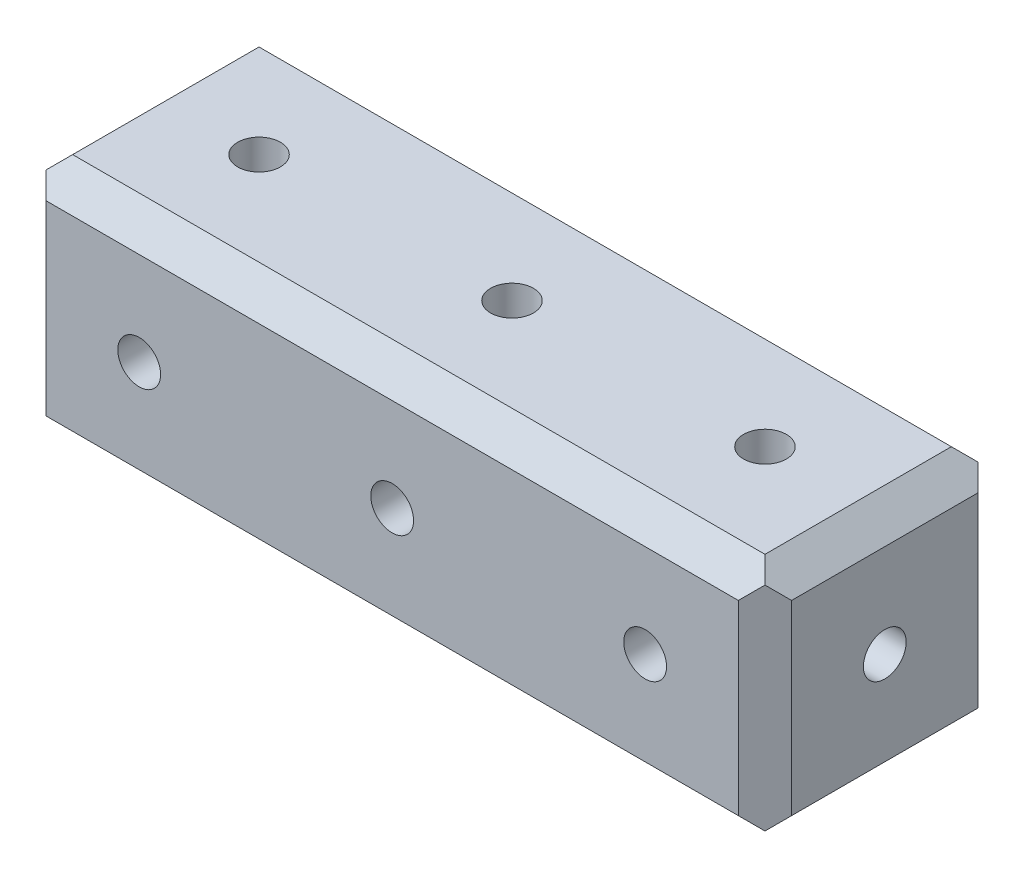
ISO-10303-21;
HEADER;
FILE_DESCRIPTION(('STEP AP214'),'2;1');
FILE_NAME('part.step','',(''),(''),'','','');
FILE_SCHEMA(('AUTOMOTIVE_DESIGN { 1 0 10303 214 1 1 1 1 }'));
ENDSEC;
DATA;
#1=APPLICATION_CONTEXT('core data for automotive mechanical design processes');
#2=APPLICATION_PROTOCOL_DEFINITION('international standard','automotive_design',2000,#1);
#3=PRODUCT_CONTEXT('',#1,'mechanical');
#4=PRODUCT('Part','Part','',(#3));
#5=PRODUCT_RELATED_PRODUCT_CATEGORY('part','',(#4));
#6=PRODUCT_DEFINITION_FORMATION('','',#4);
#7=PRODUCT_DEFINITION_CONTEXT('part definition',#1,'design');
#8=PRODUCT_DEFINITION('design','',#6,#7);
#9=PRODUCT_DEFINITION_SHAPE('','',#8);
#10=(LENGTH_UNIT() NAMED_UNIT(*) SI_UNIT(.MILLI.,.METRE.));
#11=(NAMED_UNIT(*) PLANE_ANGLE_UNIT() SI_UNIT($,.RADIAN.));
#12=(NAMED_UNIT(*) SI_UNIT($,.STERADIAN.) SOLID_ANGLE_UNIT());
#13=UNCERTAINTY_MEASURE_WITH_UNIT(LENGTH_MEASURE(1.E-05),#10,'distance_accuracy_value','');
#14=(GEOMETRIC_REPRESENTATION_CONTEXT(3) GLOBAL_UNCERTAINTY_ASSIGNED_CONTEXT((#13)) GLOBAL_UNIT_ASSIGNED_CONTEXT((#10,
#11,#12)) REPRESENTATION_CONTEXT('',''));
#15=CARTESIAN_POINT('',(0.,0.,0.));
#16=DIRECTION('',(0.,0.,1.));
#17=DIRECTION('',(1.,0.,0.));
#18=AXIS2_PLACEMENT_3D('',#15,#16,#17);
#19=CARTESIAN_POINT('',(0.,14.2875,0.));
#20=DIRECTION('',(0.,1.,0.));
#21=DIRECTION('',(0.,0.,1.));
#22=AXIS2_PLACEMENT_3D('',#19,#20,#21);
#23=CYLINDRICAL_SURFACE('',#22,2.5527);
#24=CARTESIAN_POINT('',(0.,14.2875,0.));
#25=DIRECTION('',(0.,1.,0.));
#26=DIRECTION('',(0.,0.,1.));
#27=AXIS2_PLACEMENT_3D('',#24,#25,#26);
#28=CIRCLE('',#27,2.5527);
#29=CARTESIAN_POINT('',(0.,14.2875,2.5527));
#30=VERTEX_POINT('',#29);
#31=EDGE_CURVE('E567',#30,#30,#28,.T.);
#32=ORIENTED_EDGE('',*,*,#31,.T.);
#33=EDGE_LOOP('',(#32));
#34=FACE_BOUND('',#33,.T.);
#35=CARTESIAN_POINT('',(0.,0.,0.));
#36=DIRECTION('',(0.,0.707106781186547,-0.707106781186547));
#37=DIRECTION('',(0.,0.707106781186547,0.707106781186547));
#38=AXIS2_PLACEMENT_3D('',#35,#36,#37);
#39=ELLIPSE('',#38,3.6100629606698,2.5527);
#40=CARTESIAN_POINT('',(1.8050314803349,1.8050314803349,1.8050314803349));
#41=VERTEX_POINT('',#40);
#42=CARTESIAN_POINT('',(-1.8050314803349,1.8050314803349,1.8050314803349));
#43=VERTEX_POINT('',#42);
#44=EDGE_CURVE('E572',#41,#43,#39,.F.);
#45=ORIENTED_EDGE('',*,*,#44,.T.);
#46=CARTESIAN_POINT('',(0.,0.,0.));
#47=DIRECTION('',(0.707106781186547,0.707106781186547,0.));
#48=DIRECTION('',(-0.707106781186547,0.707106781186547,0.));
#49=AXIS2_PLACEMENT_3D('',#46,#47,#48);
#50=ELLIPSE('',#49,3.6100629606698,2.5527);
#51=CARTESIAN_POINT('',(-1.8050314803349,1.8050314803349,-1.8050314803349));
#52=VERTEX_POINT('',#51);
#53=EDGE_CURVE('E555',#43,#52,#50,.F.);
#54=ORIENTED_EDGE('',*,*,#53,.T.);
#55=CARTESIAN_POINT('',(0.,0.,0.));
#56=DIRECTION('',(0.,0.707106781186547,0.707106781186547));
#57=DIRECTION('',(0.,0.707106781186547,-0.707106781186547));
#58=AXIS2_PLACEMENT_3D('',#55,#56,#57);
#59=ELLIPSE('',#58,3.6100629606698,2.5527);
#60=CARTESIAN_POINT('',(1.8050314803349,1.8050314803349,-1.8050314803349));
#61=VERTEX_POINT('',#60);
#62=EDGE_CURVE('E581',#52,#61,#59,.F.);
#63=ORIENTED_EDGE('',*,*,#62,.T.);
#64=CARTESIAN_POINT('',(0.,0.,0.));
#65=DIRECTION('',(-0.707106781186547,0.707106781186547,0.));
#66=DIRECTION('',(0.707106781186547,0.707106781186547,0.));
#67=AXIS2_PLACEMENT_3D('',#64,#65,#66);
#68=ELLIPSE('',#67,3.6100629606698,2.5527);
#69=EDGE_CURVE('E540',#61,#41,#68,.F.);
#70=ORIENTED_EDGE('',*,*,#69,.T.);
#71=EDGE_LOOP('',(#45,#54,#63,#70));
#72=FACE_BOUND('',#71,.T.);
#73=ADVANCED_FACE('F15',(#34,#72),#23,.F.);
#74=CARTESIAN_POINT('',(14.2875,-14.2875,14.2875));
#75=DIRECTION('',(0.,0.,1.));
#76=DIRECTION('',(1.,0.,0.));
#77=AXIS2_PLACEMENT_3D('',#74,#75,#76);
#78=PLANE('',#77);
#79=CARTESIAN_POINT('',(60.325,0.,14.2875));
#80=DIRECTION('',(0.,0.,1.));
#81=DIRECTION('',(1.,0.,0.));
#82=AXIS2_PLACEMENT_3D('',#79,#80,#81);
#83=CIRCLE('',#82,2.55269999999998);
#84=CARTESIAN_POINT('',(62.8777,0.,14.2875));
#85=VERTEX_POINT('',#84);
#86=EDGE_CURVE('E507',#85,#85,#83,.T.);
#87=ORIENTED_EDGE('',*,*,#86,.F.);
#88=EDGE_LOOP('',(#87));
#89=FACE_BOUND('',#88,.T.);
#90=CARTESIAN_POINT('',(30.1625,0.,14.2875));
#91=DIRECTION('',(0.,0.,1.));
#92=DIRECTION('',(1.,0.,0.));
#93=AXIS2_PLACEMENT_3D('',#90,#91,#92);
#94=CIRCLE('',#93,2.5527);
#95=CARTESIAN_POINT('',(32.7152,0.,14.2875));
#96=VERTEX_POINT('',#95);
#97=EDGE_CURVE('E537',#96,#96,#94,.T.);
#98=ORIENTED_EDGE('',*,*,#97,.F.);
#99=EDGE_LOOP('',(#98));
#100=FACE_BOUND('',#99,.T.);
#101=CARTESIAN_POINT('',(0.,0.,14.2875));
#102=DIRECTION('',(0.,0.,1.));
#103=DIRECTION('',(1.,0.,0.));
#104=AXIS2_PLACEMENT_3D('',#101,#102,#103);
#105=CIRCLE('',#104,2.5527);
#106=CARTESIAN_POINT('',(2.5527,0.,14.2875));
#107=VERTEX_POINT('',#106);
#108=EDGE_CURVE('E561',#107,#107,#105,.T.);
#109=ORIENTED_EDGE('',*,*,#108,.F.);
#110=EDGE_LOOP('',(#109));
#111=FACE_BOUND('',#110,.T.);
#112=DIRECTION('',(0.,-1.,0.));
#113=VECTOR('',#112,1.);
#114=CARTESIAN_POINT('',(-11.1125,-14.2875,14.2875));
#115=LINE('',#114,#113);
#116=CARTESIAN_POINT('',(-11.1125,11.1125,14.2875));
#117=VERTEX_POINT('',#116);
#118=CARTESIAN_POINT('',(-11.1125,-11.1125,14.2875));
#119=VERTEX_POINT('',#118);
#120=EDGE_CURVE('E285',#117,#119,#115,.T.);
#121=ORIENTED_EDGE('',*,*,#120,.T.);
#122=DIRECTION('',(1.,0.,0.));
#123=VECTOR('',#122,1.);
#124=CARTESIAN_POINT('',(14.2875,-11.1125,14.2875));
#125=LINE('',#124,#123);
#126=CARTESIAN_POINT('',(71.4375,-11.1125,14.2875));
#127=VERTEX_POINT('',#126);
#128=EDGE_CURVE('E339',#119,#127,#125,.T.);
#129=ORIENTED_EDGE('',*,*,#128,.T.);
#130=DIRECTION('',(0.,1.,0.));
#131=VECTOR('',#130,1.);
#132=CARTESIAN_POINT('',(71.4375,-14.2875,14.2875));
#133=LINE('',#132,#131);
#134=CARTESIAN_POINT('',(71.4375,11.1125,14.2875));
#135=VERTEX_POINT('',#134);
#136=EDGE_CURVE('E288',#127,#135,#133,.T.);
#137=ORIENTED_EDGE('',*,*,#136,.T.);
#138=DIRECTION('',(-1.,0.,0.));
#139=VECTOR('',#138,1.);
#140=CARTESIAN_POINT('',(14.2875,11.1125,14.2875));
#141=LINE('',#140,#139);
#142=EDGE_CURVE('E336',#135,#117,#141,.T.);
#143=ORIENTED_EDGE('',*,*,#142,.T.);
#144=EDGE_LOOP('',(#121,#129,#137,#143));
#145=FACE_BOUND('',#144,.T.);
#146=ADVANCED_FACE('F366',(#89,#100,#111,#145),#78,.T.);
#147=CARTESIAN_POINT('',(14.2875,-14.2875,-14.2875));
#148=DIRECTION('',(0.,-1.,0.));
#149=DIRECTION('',(1.,0.,0.));
#150=AXIS2_PLACEMENT_3D('',#147,#148,#149);
#151=PLANE('',#150);
#152=CARTESIAN_POINT('',(60.325,-14.2875,1.51002848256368E-13));
#153=DIRECTION('',(0.,-1.,0.));
#154=DIRECTION('',(1.,0.,0.));
#155=AXIS2_PLACEMENT_3D('',#152,#153,#154);
#156=CIRCLE('',#155,2.55269999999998);
#157=CARTESIAN_POINT('',(62.8777,-14.2875,1.50692910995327E-13));
#158=VERTEX_POINT('',#157);
#159=EDGE_CURVE('E498',#158,#158,#156,.T.);
#160=ORIENTED_EDGE('',*,*,#159,.F.);
#161=EDGE_LOOP('',(#160));
#162=FACE_BOUND('',#161,.T.);
#163=CARTESIAN_POINT('',(30.1625,-14.2875,1.49460871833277E-13));
#164=DIRECTION('',(0.,-1.,0.));
#165=DIRECTION('',(1.,0.,0.));
#166=AXIS2_PLACEMENT_3D('',#163,#164,#165);
#167=CIRCLE('',#166,2.5527);
#168=CARTESIAN_POINT('',(32.7152,-14.2875,1.49150934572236E-13));
#169=VERTEX_POINT('',#168);
#170=EDGE_CURVE('E528',#169,#169,#167,.T.);
#171=ORIENTED_EDGE('',*,*,#170,.F.);
#172=EDGE_LOOP('',(#171));
#173=FACE_BOUND('',#172,.T.);
#174=CARTESIAN_POINT('',(0.,-14.2875,0.));
#175=DIRECTION('',(0.,1.,0.));
#176=DIRECTION('',(0.,0.,1.));
#177=AXIS2_PLACEMENT_3D('',#174,#175,#176);
#178=CIRCLE('',#177,2.5527);
#179=CARTESIAN_POINT('',(0.,-14.2875,2.5527));
#180=VERTEX_POINT('',#179);
#181=EDGE_CURVE('E569',#180,#180,#178,.T.);
#182=ORIENTED_EDGE('',*,*,#181,.T.);
#183=EDGE_LOOP('',(#182));
#184=FACE_BOUND('',#183,.T.);
#185=DIRECTION('',(0.,0.,-1.));
#186=VECTOR('',#185,1.);
#187=CARTESIAN_POINT('',(-11.1125,-14.2875,-14.2875));
#188=LINE('',#187,#186);
#189=CARTESIAN_POINT('',(-11.1125,-14.2875,11.1125));
#190=VERTEX_POINT('',#189);
#191=CARTESIAN_POINT('',(-11.1125,-14.2875,-11.1125));
#192=VERTEX_POINT('',#191);
#193=EDGE_CURVE('E249',#190,#192,#188,.T.);
#194=ORIENTED_EDGE('',*,*,#193,.T.);
#195=DIRECTION('',(1.,0.,0.));
#196=VECTOR('',#195,1.);
#197=CARTESIAN_POINT('',(14.2875,-14.2875,-11.1125));
#198=LINE('',#197,#196);
#199=CARTESIAN_POINT('',(71.4375,-14.2875,-11.1125));
#200=VERTEX_POINT('',#199);
#201=EDGE_CURVE('E322',#192,#200,#198,.T.);
#202=ORIENTED_EDGE('',*,*,#201,.T.);
#203=DIRECTION('',(0.,0.,1.));
#204=VECTOR('',#203,1.);
#205=CARTESIAN_POINT('',(71.4375,-14.2875,-14.2875));
#206=LINE('',#205,#204);
#207=CARTESIAN_POINT('',(71.4375,-14.2875,11.1125));
#208=VERTEX_POINT('',#207);
#209=EDGE_CURVE('E246',#200,#208,#206,.T.);
#210=ORIENTED_EDGE('',*,*,#209,.T.);
#211=DIRECTION('',(-1.,0.,0.));
#212=VECTOR('',#211,1.);
#213=CARTESIAN_POINT('',(14.2875,-14.2875,11.1125));
#214=LINE('',#213,#212);
#215=EDGE_CURVE('E319',#208,#190,#214,.T.);
#216=ORIENTED_EDGE('',*,*,#215,.T.);
#217=EDGE_LOOP('',(#194,#202,#210,#216));
#218=FACE_BOUND('',#217,.T.);
#219=ADVANCED_FACE('F384',(#162,#173,#184,#218),#151,.T.);
#220=CARTESIAN_POINT('',(14.2875,14.2875,-14.2875));
#221=DIRECTION('',(0.,0.,-1.));
#222=DIRECTION('',(-1.,0.,0.));
#223=AXIS2_PLACEMENT_3D('',#220,#221,#222);
#224=PLANE('',#223);
#225=CARTESIAN_POINT('',(60.325,0.,-14.2875));
#226=DIRECTION('',(0.,0.,-1.));
#227=DIRECTION('',(1.,0.,0.));
#228=AXIS2_PLACEMENT_3D('',#225,#226,#227);
#229=CIRCLE('',#228,2.55269999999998);
#230=CARTESIAN_POINT('',(62.8777,0.,-14.2875));
#231=VERTEX_POINT('',#230);
#232=EDGE_CURVE('E501',#231,#231,#229,.T.);
#233=ORIENTED_EDGE('',*,*,#232,.F.);
#234=EDGE_LOOP('',(#233));
#235=FACE_BOUND('',#234,.T.);
#236=CARTESIAN_POINT('',(30.1625,0.,-14.2875));
#237=DIRECTION('',(0.,0.,-1.));
#238=DIRECTION('',(1.,0.,0.));
#239=AXIS2_PLACEMENT_3D('',#236,#237,#238);
#240=CIRCLE('',#239,2.5527);
#241=CARTESIAN_POINT('',(32.7152,0.,-14.2875));
#242=VERTEX_POINT('',#241);
#243=EDGE_CURVE('E531',#242,#242,#240,.T.);
#244=ORIENTED_EDGE('',*,*,#243,.F.);
#245=EDGE_LOOP('',(#244));
#246=FACE_BOUND('',#245,.T.);
#247=CARTESIAN_POINT('',(0.,0.,-14.2875));
#248=DIRECTION('',(0.,0.,-1.));
#249=DIRECTION('',(-1.,0.,0.));
#250=AXIS2_PLACEMENT_3D('',#247,#248,#249);
#251=CIRCLE('',#250,2.5527);
#252=CARTESIAN_POINT('',(-2.5527,0.,-14.2875));
#253=VERTEX_POINT('',#252);
#254=EDGE_CURVE('E564',#253,#253,#251,.T.);
#255=ORIENTED_EDGE('',*,*,#254,.F.);
#256=EDGE_LOOP('',(#255));
#257=FACE_BOUND('',#256,.T.);
#258=DIRECTION('',(0.,-1.,0.));
#259=VECTOR('',#258,1.);
#260=CARTESIAN_POINT('',(71.4375,14.2875,-14.2875));
#261=LINE('',#260,#259);
#262=CARTESIAN_POINT('',(71.4375,11.1125,-14.2875));
#263=VERTEX_POINT('',#262);
#264=CARTESIAN_POINT('',(71.4375,-11.1125,-14.2875));
#265=VERTEX_POINT('',#264);
#266=EDGE_CURVE('E277',#263,#265,#261,.T.);
#267=ORIENTED_EDGE('',*,*,#266,.T.);
#268=DIRECTION('',(-1.,0.,0.));
#269=VECTOR('',#268,1.);
#270=CARTESIAN_POINT('',(14.2875,-11.1125,-14.2875));
#271=LINE('',#270,#269);
#272=CARTESIAN_POINT('',(-11.1125,-11.1125,-14.2875));
#273=VERTEX_POINT('',#272);
#274=EDGE_CURVE('E308',#265,#273,#271,.T.);
#275=ORIENTED_EDGE('',*,*,#274,.T.);
#276=DIRECTION('',(0.,1.,0.));
#277=VECTOR('',#276,1.);
#278=CARTESIAN_POINT('',(-11.1125,14.2875,-14.2875));
#279=LINE('',#278,#277);
#280=CARTESIAN_POINT('',(-11.1125,11.1125,-14.2875));
#281=VERTEX_POINT('',#280);
#282=EDGE_CURVE('E274',#273,#281,#279,.T.);
#283=ORIENTED_EDGE('',*,*,#282,.T.);
#284=DIRECTION('',(1.,0.,0.));
#285=VECTOR('',#284,1.);
#286=CARTESIAN_POINT('',(14.2875,11.1125,-14.2875));
#287=LINE('',#286,#285);
#288=EDGE_CURVE('E306',#281,#263,#287,.T.);
#289=ORIENTED_EDGE('',*,*,#288,.T.);
#290=EDGE_LOOP('',(#267,#275,#283,#289));
#291=FACE_BOUND('',#290,.T.);
#292=ADVANCED_FACE('F402',(#235,#246,#257,#291),#224,.T.);
#293=CARTESIAN_POINT('',(14.2875,14.2875,14.2875));
#294=DIRECTION('',(0.,1.,0.));
#295=DIRECTION('',(-1.,0.,0.));
#296=AXIS2_PLACEMENT_3D('',#293,#294,#295);
#297=PLANE('',#296);
#298=CARTESIAN_POINT('',(60.325,14.2875,0.));
#299=DIRECTION('',(0.,1.,0.));
#300=DIRECTION('',(1.,0.,0.));
#301=AXIS2_PLACEMENT_3D('',#298,#299,#300);
#302=CIRCLE('',#301,2.55269999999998);
#303=CARTESIAN_POINT('',(62.8777,14.2875,0.));
#304=VERTEX_POINT('',#303);
#305=EDGE_CURVE('E504',#304,#304,#302,.T.);
#306=ORIENTED_EDGE('',*,*,#305,.F.);
#307=EDGE_LOOP('',(#306));
#308=FACE_BOUND('',#307,.T.);
#309=CARTESIAN_POINT('',(30.1625,14.2875,0.));
#310=DIRECTION('',(0.,1.,0.));
#311=DIRECTION('',(1.,0.,0.));
#312=AXIS2_PLACEMENT_3D('',#309,#310,#311);
#313=CIRCLE('',#312,2.5527);
#314=CARTESIAN_POINT('',(32.7152,14.2875,0.));
#315=VERTEX_POINT('',#314);
#316=EDGE_CURVE('E534',#315,#315,#313,.T.);
#317=ORIENTED_EDGE('',*,*,#316,.F.);
#318=EDGE_LOOP('',(#317));
#319=FACE_BOUND('',#318,.T.);
#320=ORIENTED_EDGE('',*,*,#31,.F.);
#321=EDGE_LOOP('',(#320));
#322=FACE_BOUND('',#321,.T.);
#323=DIRECTION('',(0.,0.,-1.));
#324=VECTOR('',#323,1.);
#325=CARTESIAN_POINT('',(71.4375,14.2875,14.2875));
#326=LINE('',#325,#324);
#327=CARTESIAN_POINT('',(71.4375,14.2875,11.1125));
#328=VERTEX_POINT('',#327);
#329=CARTESIAN_POINT('',(71.4375,14.2875,-11.1125));
#330=VERTEX_POINT('',#329);
#331=EDGE_CURVE('E260',#328,#330,#326,.T.);
#332=ORIENTED_EDGE('',*,*,#331,.T.);
#333=DIRECTION('',(-1.,0.,0.));
#334=VECTOR('',#333,1.);
#335=CARTESIAN_POINT('',(14.2875,14.2875,-11.1125));
#336=LINE('',#335,#334);
#337=CARTESIAN_POINT('',(-11.1125,14.2875,-11.1125));
#338=VERTEX_POINT('',#337);
#339=EDGE_CURVE('E347',#330,#338,#336,.T.);
#340=ORIENTED_EDGE('',*,*,#339,.T.);
#341=DIRECTION('',(0.,0.,1.));
#342=VECTOR('',#341,1.);
#343=CARTESIAN_POINT('',(-11.1125,14.2875,14.2875));
#344=LINE('',#343,#342);
#345=CARTESIAN_POINT('',(-11.1125,14.2875,11.1125));
#346=VERTEX_POINT('',#345);
#347=EDGE_CURVE('E258',#338,#346,#344,.T.);
#348=ORIENTED_EDGE('',*,*,#347,.T.);
#349=DIRECTION('',(1.,0.,0.));
#350=VECTOR('',#349,1.);
#351=CARTESIAN_POINT('',(14.2875,14.2875,11.1125));
#352=LINE('',#351,#350);
#353=EDGE_CURVE('E345',#346,#328,#352,.T.);
#354=ORIENTED_EDGE('',*,*,#353,.T.);
#355=EDGE_LOOP('',(#332,#340,#348,#354));
#356=FACE_BOUND('',#355,.T.);
#357=ADVANCED_FACE('F412',(#308,#319,#322,#356),#297,.T.);
#358=CARTESIAN_POINT('',(-14.2875,0.,0.));
#359=DIRECTION('',(-1.,0.,0.));
#360=DIRECTION('',(0.,-1.,0.));
#361=AXIS2_PLACEMENT_3D('',#358,#359,#360);
#362=PLANE('',#361);
#363=CARTESIAN_POINT('',(-14.2875,0.,0.));
#364=DIRECTION('',(-1.,0.,0.));
#365=DIRECTION('',(0.,-1.,0.));
#366=AXIS2_PLACEMENT_3D('',#363,#364,#365);
#367=CIRCLE('',#366,2.5527);
#368=CARTESIAN_POINT('',(-14.2875,-2.5527,0.));
#369=VERTEX_POINT('',#368);
#370=EDGE_CURVE('E558',#369,#369,#367,.T.);
#371=ORIENTED_EDGE('',*,*,#370,.F.);
#372=EDGE_LOOP('',(#371));
#373=FACE_BOUND('',#372,.T.);
#374=DIRECTION('',(0.,0.,-1.));
#375=VECTOR('',#374,1.);
#376=CARTESIAN_POINT('',(-14.2875,11.1125,0.));
#377=LINE('',#376,#375);
#378=CARTESIAN_POINT('',(-14.2875,11.1125,11.1125));
#379=VERTEX_POINT('',#378);
#380=CARTESIAN_POINT('',(-14.2875,11.1125,-11.1125));
#381=VERTEX_POINT('',#380);
#382=EDGE_CURVE('E240',#379,#381,#377,.T.);
#383=ORIENTED_EDGE('',*,*,#382,.T.);
#384=DIRECTION('',(0.,-1.,0.));
#385=VECTOR('',#384,1.);
#386=CARTESIAN_POINT('',(-14.2875,0.,-11.1125));
#387=LINE('',#386,#385);
#388=CARTESIAN_POINT('',(-14.2875,-11.1125,-11.1125));
#389=VERTEX_POINT('',#388);
#390=EDGE_CURVE('E294',#381,#389,#387,.T.);
#391=ORIENTED_EDGE('',*,*,#390,.T.);
#392=DIRECTION('',(0.,0.,1.));
#393=VECTOR('',#392,1.);
#394=CARTESIAN_POINT('',(-14.2875,-11.1125,0.));
#395=LINE('',#394,#393);
#396=CARTESIAN_POINT('',(-14.2875,-11.1125,11.1125));
#397=VERTEX_POINT('',#396);
#398=EDGE_CURVE('E243',#389,#397,#395,.T.);
#399=ORIENTED_EDGE('',*,*,#398,.T.);
#400=DIRECTION('',(0.,1.,0.));
#401=VECTOR('',#400,1.);
#402=CARTESIAN_POINT('',(-14.2875,0.,11.1125));
#403=LINE('',#402,#401);
#404=EDGE_CURVE('E291',#397,#379,#403,.T.);
#405=ORIENTED_EDGE('',*,*,#404,.T.);
#406=EDGE_LOOP('',(#383,#391,#399,#405));
#407=FACE_BOUND('',#406,.T.);
#408=ADVANCED_FACE('F416',(#373,#407),#362,.T.);
#409=CARTESIAN_POINT('',(0.,0.,0.));
#410=DIRECTION('',(0.,0.707106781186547,0.707106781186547));
#411=DIRECTION('',(0.,0.707106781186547,-0.707106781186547));
#412=AXIS2_PLACEMENT_3D('',#409,#410,#411);
#413=ELLIPSE('',#412,3.6100629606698,2.5527);
#414=CARTESIAN_POINT('',(-1.8050314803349,-1.8050314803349,1.8050314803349));
#415=VERTEX_POINT('',#414);
#416=CARTESIAN_POINT('',(1.8050314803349,-1.8050314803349,1.8050314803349));
#417=VERTEX_POINT('',#416);
#418=EDGE_CURVE('E578',#415,#417,#413,.T.);
#419=ORIENTED_EDGE('',*,*,#418,.T.);
#420=CARTESIAN_POINT('',(0.,0.,0.));
#421=DIRECTION('',(0.707106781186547,0.707106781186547,0.));
#422=DIRECTION('',(-0.707106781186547,0.707106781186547,0.));
#423=AXIS2_PLACEMENT_3D('',#420,#421,#422);
#424=ELLIPSE('',#423,3.6100629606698,2.5527);
#425=CARTESIAN_POINT('',(1.8050314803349,-1.8050314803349,-1.8050314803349));
#426=VERTEX_POINT('',#425);
#427=EDGE_CURVE('E543',#417,#426,#424,.T.);
#428=ORIENTED_EDGE('',*,*,#427,.T.);
#429=CARTESIAN_POINT('',(0.,0.,0.));
#430=DIRECTION('',(0.,0.707106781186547,-0.707106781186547));
#431=DIRECTION('',(0.,0.707106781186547,0.707106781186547));
#432=AXIS2_PLACEMENT_3D('',#429,#430,#431);
#433=ELLIPSE('',#432,3.6100629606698,2.5527);
#434=CARTESIAN_POINT('',(-1.8050314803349,-1.8050314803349,-1.8050314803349));
#435=VERTEX_POINT('',#434);
#436=EDGE_CURVE('E575',#426,#435,#433,.T.);
#437=ORIENTED_EDGE('',*,*,#436,.T.);
#438=CARTESIAN_POINT('',(0.,0.,0.));
#439=DIRECTION('',(-0.707106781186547,0.707106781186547,0.));
#440=DIRECTION('',(0.707106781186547,0.707106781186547,0.));
#441=AXIS2_PLACEMENT_3D('',#438,#439,#440);
#442=ELLIPSE('',#441,3.6100629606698,2.5527);
#443=EDGE_CURVE('E552',#435,#415,#442,.T.);
#444=ORIENTED_EDGE('',*,*,#443,.T.);
#445=EDGE_LOOP('',(#419,#428,#437,#444));
#446=FACE_BOUND('',#445,.T.);
#447=ORIENTED_EDGE('',*,*,#181,.F.);
#448=EDGE_LOOP('',(#447));
#449=FACE_BOUND('',#448,.T.);
#450=ADVANCED_FACE('F418',(#446,#449),#23,.F.);
#451=CARTESIAN_POINT('',(0.,0.,14.2875));
#452=DIRECTION('',(0.,0.,1.));
#453=DIRECTION('',(1.,0.,0.));
#454=AXIS2_PLACEMENT_3D('',#451,#452,#453);
#455=CYLINDRICAL_SURFACE('',#454,2.5527);
#456=ORIENTED_EDGE('',*,*,#108,.T.);
#457=EDGE_LOOP('',(#456));
#458=FACE_BOUND('',#457,.T.);
#459=ORIENTED_EDGE('',*,*,#418,.F.);
#460=CARTESIAN_POINT('',(0.,0.,0.));
#461=DIRECTION('',(0.707106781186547,0.,0.707106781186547));
#462=DIRECTION('',(-0.707106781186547,0.,0.707106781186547));
#463=AXIS2_PLACEMENT_3D('',#460,#461,#462);
#464=ELLIPSE('',#463,3.6100629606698,2.5527);
#465=EDGE_CURVE('E587',#415,#43,#464,.F.);
#466=ORIENTED_EDGE('',*,*,#465,.T.);
#467=ORIENTED_EDGE('',*,*,#44,.F.);
#468=CARTESIAN_POINT('',(0.,0.,0.));
#469=DIRECTION('',(-0.707106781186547,0.,0.707106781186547));
#470=DIRECTION('',(0.707106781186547,0.,0.707106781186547));
#471=AXIS2_PLACEMENT_3D('',#468,#469,#470);
#472=ELLIPSE('',#471,3.6100629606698,2.5527);
#473=EDGE_CURVE('E584',#41,#417,#472,.F.);
#474=ORIENTED_EDGE('',*,*,#473,.T.);
#475=EDGE_LOOP('',(#459,#466,#467,#474));
#476=FACE_BOUND('',#475,.T.);
#477=ADVANCED_FACE('F426',(#458,#476),#455,.F.);
#478=ORIENTED_EDGE('',*,*,#254,.T.);
#479=EDGE_LOOP('',(#478));
#480=FACE_BOUND('',#479,.T.);
#481=ORIENTED_EDGE('',*,*,#436,.F.);
#482=CARTESIAN_POINT('',(0.,0.,0.));
#483=DIRECTION('',(0.707106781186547,0.,0.707106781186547));
#484=DIRECTION('',(-0.707106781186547,0.,0.707106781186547));
#485=AXIS2_PLACEMENT_3D('',#482,#483,#484);
#486=ELLIPSE('',#485,3.6100629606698,2.5527);
#487=EDGE_CURVE('E546',#426,#61,#486,.T.);
#488=ORIENTED_EDGE('',*,*,#487,.T.);
#489=ORIENTED_EDGE('',*,*,#62,.F.);
#490=CARTESIAN_POINT('',(0.,0.,0.));
#491=DIRECTION('',(-0.707106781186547,0.,0.707106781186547));
#492=DIRECTION('',(0.707106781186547,0.,0.707106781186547));
#493=AXIS2_PLACEMENT_3D('',#490,#491,#492);
#494=ELLIPSE('',#493,3.6100629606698,2.5527);
#495=EDGE_CURVE('E549',#52,#435,#494,.T.);
#496=ORIENTED_EDGE('',*,*,#495,.T.);
#497=EDGE_LOOP('',(#481,#488,#489,#496));
#498=FACE_BOUND('',#497,.T.);
#499=ADVANCED_FACE('F443',(#480,#498),#455,.F.);
#500=CARTESIAN_POINT('',(14.2875,0.,0.));
#501=DIRECTION('',(1.,0.,0.));
#502=DIRECTION('',(0.,0.,-1.));
#503=AXIS2_PLACEMENT_3D('',#500,#501,#502);
#504=CYLINDRICAL_SURFACE('',#503,2.5527);
#505=ORIENTED_EDGE('',*,*,#427,.F.);
#506=ORIENTED_EDGE('',*,*,#473,.F.);
#507=ORIENTED_EDGE('',*,*,#69,.F.);
#508=ORIENTED_EDGE('',*,*,#487,.F.);
#509=EDGE_LOOP('',(#505,#506,#507,#508));
#510=FACE_BOUND('',#509,.T.);
#511=CARTESIAN_POINT('',(30.1625,0.,0.));
#512=DIRECTION('',(-0.707106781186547,0.,0.707106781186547));
#513=DIRECTION('',(0.707106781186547,0.,0.707106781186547));
#514=AXIS2_PLACEMENT_3D('',#511,#512,#513);
#515=ELLIPSE('',#514,3.6100629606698,2.5527);
#516=CARTESIAN_POINT('',(28.3574685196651,1.8050314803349,-1.8050314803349));
#517=VERTEX_POINT('',#516);
#518=CARTESIAN_POINT('',(28.3574685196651,-1.8050314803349,-1.8050314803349));
#519=VERTEX_POINT('',#518);
#520=EDGE_CURVE('E513',#517,#519,#515,.T.);
#521=ORIENTED_EDGE('',*,*,#520,.F.);
#522=CARTESIAN_POINT('',(30.1625,0.,0.));
#523=DIRECTION('',(0.707106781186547,0.707106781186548,0.));
#524=DIRECTION('',(-0.707106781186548,0.707106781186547,0.));
#525=AXIS2_PLACEMENT_3D('',#522,#523,#524);
#526=ELLIPSE('',#525,3.6100629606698,2.5527);
#527=CARTESIAN_POINT('',(28.3574685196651,1.8050314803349,1.80503148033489));
#528=VERTEX_POINT('',#527);
#529=EDGE_CURVE('E234',#528,#517,#526,.F.);
#530=ORIENTED_EDGE('',*,*,#529,.F.);
#531=CARTESIAN_POINT('',(30.1625,0.,0.));
#532=DIRECTION('',(0.707106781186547,0.,0.707106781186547));
#533=DIRECTION('',(-0.707106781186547,0.,0.707106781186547));
#534=AXIS2_PLACEMENT_3D('',#531,#532,#533);
#535=ELLIPSE('',#534,3.6100629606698,2.5527);
#536=CARTESIAN_POINT('',(28.3574685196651,-1.80503148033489,1.8050314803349));
#537=VERTEX_POINT('',#536);
#538=EDGE_CURVE('E510',#537,#528,#535,.F.);
#539=ORIENTED_EDGE('',*,*,#538,.F.);
#540=CARTESIAN_POINT('',(30.1625,0.,0.));
#541=DIRECTION('',(-0.707106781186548,0.707106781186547,0.));
#542=DIRECTION('',(0.707106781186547,0.707106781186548,0.));
#543=AXIS2_PLACEMENT_3D('',#540,#541,#542);
#544=ELLIPSE('',#543,3.6100629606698,2.5527);
#545=EDGE_CURVE('E516',#519,#537,#544,.T.);
#546=ORIENTED_EDGE('',*,*,#545,.F.);
#547=EDGE_LOOP('',(#521,#530,#539,#546));
#548=FACE_BOUND('',#547,.T.);
#549=ADVANCED_FACE('F446',(#510,#548),#504,.F.);
#550=ORIENTED_EDGE('',*,*,#370,.T.);
#551=EDGE_LOOP('',(#550));
#552=FACE_BOUND('',#551,.T.);
#553=ORIENTED_EDGE('',*,*,#465,.F.);
#554=ORIENTED_EDGE('',*,*,#443,.F.);
#555=ORIENTED_EDGE('',*,*,#495,.F.);
#556=ORIENTED_EDGE('',*,*,#53,.F.);
#557=EDGE_LOOP('',(#553,#554,#555,#556));
#558=FACE_BOUND('',#557,.T.);
#559=ADVANCED_FACE('F448',(#552,#558),#504,.F.);
#560=CARTESIAN_POINT('',(30.1625,0.,14.2875));
#561=DIRECTION('',(0.,0.,1.));
#562=DIRECTION('',(1.,0.,0.));
#563=AXIS2_PLACEMENT_3D('',#560,#561,#562);
#564=CYLINDRICAL_SURFACE('',#563,2.5527);
#565=CARTESIAN_POINT('',(30.1625,0.,0.));
#566=DIRECTION('',(0.,-0.707106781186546,0.707106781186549));
#567=DIRECTION('',(0.,0.707106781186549,0.707106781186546));
#568=AXIS2_PLACEMENT_3D('',#565,#566,#567);
#569=ELLIPSE('',#568,3.61006296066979,2.5527);
#570=CARTESIAN_POINT('',(31.9675314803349,1.8050314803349,1.80503148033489));
#571=VERTEX_POINT('',#570);
#572=EDGE_CURVE('E597',#528,#571,#569,.F.);
#573=ORIENTED_EDGE('',*,*,#572,.T.);
#574=CARTESIAN_POINT('',(30.1625,0.,0.));
#575=DIRECTION('',(-0.707106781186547,0.,0.707106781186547));
#576=DIRECTION('',(0.707106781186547,0.,0.707106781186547));
#577=AXIS2_PLACEMENT_3D('',#574,#575,#576);
#578=ELLIPSE('',#577,3.6100629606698,2.5527);
#579=CARTESIAN_POINT('',(31.9675314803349,-1.80503148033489,1.8050314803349));
#580=VERTEX_POINT('',#579);
#581=EDGE_CURVE('E525',#571,#580,#578,.F.);
#582=ORIENTED_EDGE('',*,*,#581,.T.);
#583=CARTESIAN_POINT('',(30.1625,0.,0.));
#584=DIRECTION('',(0.,0.707106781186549,0.707106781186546));
#585=DIRECTION('',(0.,-0.707106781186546,0.707106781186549));
#586=AXIS2_PLACEMENT_3D('',#583,#584,#585);
#587=ELLIPSE('',#586,3.6100629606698,2.5527);
#588=EDGE_CURVE('E594',#580,#537,#587,.F.);
#589=ORIENTED_EDGE('',*,*,#588,.T.);
#590=ORIENTED_EDGE('',*,*,#538,.T.);
#591=EDGE_LOOP('',(#573,#582,#589,#590));
#592=FACE_BOUND('',#591,.T.);
#593=ORIENTED_EDGE('',*,*,#97,.T.);
#594=EDGE_LOOP('',(#593));
#595=FACE_BOUND('',#594,.T.);
#596=ADVANCED_FACE('F451',(#592,#595),#564,.F.);
#597=CARTESIAN_POINT('',(30.1625,14.2875,0.));
#598=DIRECTION('',(0.,1.,0.));
#599=DIRECTION('',(1.,0.,0.));
#600=AXIS2_PLACEMENT_3D('',#597,#598,#599);
#601=CYLINDRICAL_SURFACE('',#600,2.5527);
#602=ORIENTED_EDGE('',*,*,#316,.T.);
#603=EDGE_LOOP('',(#602));
#604=FACE_BOUND('',#603,.T.);
#605=CARTESIAN_POINT('',(30.1625,0.,0.));
#606=DIRECTION('',(0.,0.707106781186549,0.707106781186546));
#607=DIRECTION('',(0.,-0.707106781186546,0.707106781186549));
#608=AXIS2_PLACEMENT_3D('',#605,#606,#607);
#609=ELLIPSE('',#608,3.6100629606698,2.5527);
#610=CARTESIAN_POINT('',(31.9675314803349,1.8050314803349,-1.8050314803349));
#611=VERTEX_POINT('',#610);
#612=EDGE_CURVE('E590',#611,#517,#609,.T.);
#613=ORIENTED_EDGE('',*,*,#612,.F.);
#614=CARTESIAN_POINT('',(30.1625,0.,0.));
#615=DIRECTION('',(-0.707106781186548,0.707106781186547,0.));
#616=DIRECTION('',(0.707106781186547,0.707106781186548,0.));
#617=AXIS2_PLACEMENT_3D('',#614,#615,#616);
#618=ELLIPSE('',#617,3.6100629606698,2.5527);
#619=EDGE_CURVE('E229',#611,#571,#618,.F.);
#620=ORIENTED_EDGE('',*,*,#619,.T.);
#621=ORIENTED_EDGE('',*,*,#572,.F.);
#622=ORIENTED_EDGE('',*,*,#529,.T.);
#623=EDGE_LOOP('',(#613,#620,#621,#622));
#624=FACE_BOUND('',#623,.T.);
#625=ADVANCED_FACE('F455',(#604,#624),#601,.F.);
#626=ORIENTED_EDGE('',*,*,#170,.T.);
#627=EDGE_LOOP('',(#626));
#628=FACE_BOUND('',#627,.T.);
#629=CARTESIAN_POINT('',(30.1625,0.,0.));
#630=DIRECTION('',(0.,-0.707106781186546,0.707106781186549));
#631=DIRECTION('',(0.,0.707106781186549,0.707106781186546));
#632=AXIS2_PLACEMENT_3D('',#629,#630,#631);
#633=ELLIPSE('',#632,3.61006296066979,2.5527);
#634=CARTESIAN_POINT('',(31.9675314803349,-1.8050314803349,-1.8050314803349));
#635=VERTEX_POINT('',#634);
#636=EDGE_CURVE('E591',#519,#635,#633,.T.);
#637=ORIENTED_EDGE('',*,*,#636,.F.);
#638=ORIENTED_EDGE('',*,*,#545,.T.);
#639=ORIENTED_EDGE('',*,*,#588,.F.);
#640=CARTESIAN_POINT('',(30.1625,0.,0.));
#641=DIRECTION('',(0.707106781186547,0.707106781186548,0.));
#642=DIRECTION('',(-0.707106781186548,0.707106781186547,0.));
#643=AXIS2_PLACEMENT_3D('',#640,#641,#642);
#644=ELLIPSE('',#643,3.6100629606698,2.5527);
#645=EDGE_CURVE('E522',#580,#635,#644,.T.);
#646=ORIENTED_EDGE('',*,*,#645,.T.);
#647=EDGE_LOOP('',(#637,#638,#639,#646));
#648=FACE_BOUND('',#647,.T.);
#649=ADVANCED_FACE('F460',(#628,#648),#601,.F.);
#650=ORIENTED_EDGE('',*,*,#612,.T.);
#651=ORIENTED_EDGE('',*,*,#520,.T.);
#652=ORIENTED_EDGE('',*,*,#636,.T.);
#653=CARTESIAN_POINT('',(30.1625,0.,0.));
#654=DIRECTION('',(0.707106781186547,0.,0.707106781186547));
#655=DIRECTION('',(-0.707106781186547,0.,0.707106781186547));
#656=AXIS2_PLACEMENT_3D('',#653,#654,#655);
#657=ELLIPSE('',#656,3.6100629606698,2.5527);
#658=EDGE_CURVE('E519',#635,#611,#657,.T.);
#659=ORIENTED_EDGE('',*,*,#658,.T.);
#660=EDGE_LOOP('',(#650,#651,#652,#659));
#661=FACE_BOUND('',#660,.T.);
#662=ORIENTED_EDGE('',*,*,#243,.T.);
#663=EDGE_LOOP('',(#662));
#664=FACE_BOUND('',#663,.T.);
#665=ADVANCED_FACE('F457',(#661,#664),#564,.F.);
#666=CARTESIAN_POINT('',(17.4625,0.,0.));
#667=DIRECTION('',(-1.,0.,0.));
#668=DIRECTION('',(0.,0.,1.));
#669=AXIS2_PLACEMENT_3D('',#666,#667,#668);
#670=CYLINDRICAL_SURFACE('',#669,2.5527);
#671=ORIENTED_EDGE('',*,*,#619,.F.);
#672=ORIENTED_EDGE('',*,*,#658,.F.);
#673=ORIENTED_EDGE('',*,*,#645,.F.);
#674=ORIENTED_EDGE('',*,*,#581,.F.);
#675=EDGE_LOOP('',(#671,#672,#673,#674));
#676=FACE_BOUND('',#675,.T.);
#677=CARTESIAN_POINT('',(60.325,0.,0.));
#678=DIRECTION('',(0.707106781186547,0.,0.707106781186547));
#679=DIRECTION('',(-0.707106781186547,0.,0.707106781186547));
#680=AXIS2_PLACEMENT_3D('',#677,#678,#679);
#681=ELLIPSE('',#680,3.61006296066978,2.55269999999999);
#682=CARTESIAN_POINT('',(58.5199685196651,-1.80503148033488,1.80503148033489));
#683=VERTEX_POINT('',#682);
#684=CARTESIAN_POINT('',(58.5199685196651,1.8050314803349,1.80503148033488));
#685=VERTEX_POINT('',#684);
#686=EDGE_CURVE('E223',#683,#685,#681,.F.);
#687=ORIENTED_EDGE('',*,*,#686,.F.);
#688=CARTESIAN_POINT('',(60.325,0.,0.));
#689=DIRECTION('',(-0.707106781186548,0.707106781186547,0.));
#690=DIRECTION('',(0.707106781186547,0.707106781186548,0.));
#691=AXIS2_PLACEMENT_3D('',#688,#689,#690);
#692=ELLIPSE('',#691,3.61006296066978,2.55269999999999);
#693=CARTESIAN_POINT('',(58.5199685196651,-1.80503148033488,-1.80503148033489));
#694=VERTEX_POINT('',#693);
#695=EDGE_CURVE('E207',#694,#683,#692,.T.);
#696=ORIENTED_EDGE('',*,*,#695,.F.);
#697=CARTESIAN_POINT('',(60.325,0.,0.));
#698=DIRECTION('',(-0.707106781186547,0.,0.707106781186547));
#699=DIRECTION('',(0.707106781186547,0.,0.707106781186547));
#700=AXIS2_PLACEMENT_3D('',#697,#698,#699);
#701=ELLIPSE('',#700,3.61006296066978,2.55269999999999);
#702=CARTESIAN_POINT('',(58.5199685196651,1.80503148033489,-1.80503148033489));
#703=VERTEX_POINT('',#702);
#704=EDGE_CURVE('E201',#703,#694,#701,.T.);
#705=ORIENTED_EDGE('',*,*,#704,.F.);
#706=CARTESIAN_POINT('',(60.325,0.,0.));
#707=DIRECTION('',(0.707106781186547,0.707106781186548,0.));
#708=DIRECTION('',(-0.707106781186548,0.707106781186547,0.));
#709=AXIS2_PLACEMENT_3D('',#706,#707,#708);
#710=ELLIPSE('',#709,3.61006296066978,2.55269999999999);
#711=EDGE_CURVE('E204',#685,#703,#710,.F.);
#712=ORIENTED_EDGE('',*,*,#711,.F.);
#713=EDGE_LOOP('',(#687,#696,#705,#712));
#714=FACE_BOUND('',#713,.T.);
#715=ADVANCED_FACE('F203',(#676,#714),#670,.F.);
#716=CARTESIAN_POINT('',(74.6125,0.,0.));
#717=DIRECTION('',(1.,0.,0.));
#718=DIRECTION('',(0.,0.,-1.));
#719=AXIS2_PLACEMENT_3D('',#716,#717,#718);
#720=PLANE('',#719);
#721=CARTESIAN_POINT('',(74.6125,0.,0.));
#722=DIRECTION('',(1.,0.,0.));
#723=DIRECTION('',(0.,0.,-1.));
#724=AXIS2_PLACEMENT_3D('',#721,#722,#723);
#725=CIRCLE('',#724,2.55269999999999);
#726=CARTESIAN_POINT('',(74.6125,0.,-2.55269999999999));
#727=VERTEX_POINT('',#726);
#728=EDGE_CURVE('E487',#727,#727,#725,.T.);
#729=ORIENTED_EDGE('',*,*,#728,.F.);
#730=EDGE_LOOP('',(#729));
#731=FACE_BOUND('',#730,.T.);
#732=DIRECTION('',(0.,0.,-1.));
#733=VECTOR('',#732,1.);
#734=CARTESIAN_POINT('',(74.6125,-11.1125,0.));
#735=LINE('',#734,#733);
#736=CARTESIAN_POINT('',(74.6125,-11.1125,11.1125));
#737=VERTEX_POINT('',#736);
#738=CARTESIAN_POINT('',(74.6125,-11.1125,-11.1125));
#739=VERTEX_POINT('',#738);
#740=EDGE_CURVE('E255',#737,#739,#735,.T.);
#741=ORIENTED_EDGE('',*,*,#740,.T.);
#742=DIRECTION('',(0.,1.,0.));
#743=VECTOR('',#742,1.);
#744=CARTESIAN_POINT('',(74.6125,0.,-11.1125));
#745=LINE('',#744,#743);
#746=CARTESIAN_POINT('',(74.6125,11.1125,-11.1125));
#747=VERTEX_POINT('',#746);
#748=EDGE_CURVE('E266',#739,#747,#745,.T.);
#749=ORIENTED_EDGE('',*,*,#748,.T.);
#750=DIRECTION('',(0.,0.,1.));
#751=VECTOR('',#750,1.);
#752=CARTESIAN_POINT('',(74.6125,11.1125,0.));
#753=LINE('',#752,#751);
#754=CARTESIAN_POINT('',(74.6125,11.1125,11.1125));
#755=VERTEX_POINT('',#754);
#756=EDGE_CURVE('E252',#747,#755,#753,.T.);
#757=ORIENTED_EDGE('',*,*,#756,.T.);
#758=DIRECTION('',(0.,-1.,0.));
#759=VECTOR('',#758,1.);
#760=CARTESIAN_POINT('',(74.6125,0.,11.1125));
#761=LINE('',#760,#759);
#762=EDGE_CURVE('E263',#755,#737,#761,.T.);
#763=ORIENTED_EDGE('',*,*,#762,.T.);
#764=EDGE_LOOP('',(#741,#749,#757,#763));
#765=FACE_BOUND('',#764,.T.);
#766=ADVANCED_FACE('F464',(#731,#765),#720,.T.);
#767=CARTESIAN_POINT('',(60.325,0.,14.2875));
#768=DIRECTION('',(0.,0.,1.));
#769=DIRECTION('',(1.,0.,0.));
#770=AXIS2_PLACEMENT_3D('',#767,#768,#769);
#771=CYLINDRICAL_SURFACE('',#770,2.55269999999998);
#772=CARTESIAN_POINT('',(60.325,0.,0.));
#773=DIRECTION('',(0.,0.707106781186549,0.707106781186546));
#774=DIRECTION('',(0.,-0.707106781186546,0.707106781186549));
#775=AXIS2_PLACEMENT_3D('',#772,#773,#774);
#776=ELLIPSE('',#775,3.61006296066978,2.55269999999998);
#777=CARTESIAN_POINT('',(62.1300314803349,-1.80503148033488,1.80503148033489));
#778=VERTEX_POINT('',#777);
#779=EDGE_CURVE('E231',#778,#683,#776,.F.);
#780=ORIENTED_EDGE('',*,*,#779,.T.);
#781=ORIENTED_EDGE('',*,*,#686,.T.);
#782=CARTESIAN_POINT('',(60.325,0.,0.));
#783=DIRECTION('',(0.,-0.707106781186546,0.707106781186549));
#784=DIRECTION('',(0.,0.707106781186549,0.707106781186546));
#785=AXIS2_PLACEMENT_3D('',#782,#783,#784);
#786=ELLIPSE('',#785,3.61006296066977,2.55269999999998);
#787=CARTESIAN_POINT('',(62.1300314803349,1.8050314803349,1.80503148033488));
#788=VERTEX_POINT('',#787);
#789=EDGE_CURVE('E213',#685,#788,#786,.F.);
#790=ORIENTED_EDGE('',*,*,#789,.T.);
#791=CARTESIAN_POINT('',(60.325,0.,0.));
#792=DIRECTION('',(-0.707106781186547,0.,0.707106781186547));
#793=DIRECTION('',(0.707106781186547,0.,0.707106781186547));
#794=AXIS2_PLACEMENT_3D('',#791,#792,#793);
#795=ELLIPSE('',#794,3.61006296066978,2.55269999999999);
#796=EDGE_CURVE('E491',#788,#778,#795,.F.);
#797=ORIENTED_EDGE('',*,*,#796,.T.);
#798=EDGE_LOOP('',(#780,#781,#790,#797));
#799=FACE_BOUND('',#798,.T.);
#800=ORIENTED_EDGE('',*,*,#86,.T.);
#801=EDGE_LOOP('',(#800));
#802=FACE_BOUND('',#801,.T.);
#803=ADVANCED_FACE('F468',(#799,#802),#771,.F.);
#804=CARTESIAN_POINT('',(60.325,14.2875,0.));
#805=DIRECTION('',(0.,1.,0.));
#806=DIRECTION('',(1.,0.,0.));
#807=AXIS2_PLACEMENT_3D('',#804,#805,#806);
#808=CYLINDRICAL_SURFACE('',#807,2.55269999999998);
#809=ORIENTED_EDGE('',*,*,#711,.T.);
#810=CARTESIAN_POINT('',(60.325,0.,0.));
#811=DIRECTION('',(0.,0.707106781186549,0.707106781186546));
#812=DIRECTION('',(0.,-0.707106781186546,0.707106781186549));
#813=AXIS2_PLACEMENT_3D('',#810,#811,#812);
#814=ELLIPSE('',#813,3.61006296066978,2.55269999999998);
#815=CARTESIAN_POINT('',(62.1300314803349,1.80503148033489,-1.80503148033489));
#816=VERTEX_POINT('',#815);
#817=EDGE_CURVE('E221',#816,#703,#814,.T.);
#818=ORIENTED_EDGE('',*,*,#817,.F.);
#819=CARTESIAN_POINT('',(60.325,0.,0.));
#820=DIRECTION('',(-0.707106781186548,0.707106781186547,0.));
#821=DIRECTION('',(0.707106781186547,0.707106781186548,0.));
#822=AXIS2_PLACEMENT_3D('',#819,#820,#821);
#823=ELLIPSE('',#822,3.61006296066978,2.55269999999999);
#824=EDGE_CURVE('E488',#816,#788,#823,.F.);
#825=ORIENTED_EDGE('',*,*,#824,.T.);
#826=ORIENTED_EDGE('',*,*,#789,.F.);
#827=EDGE_LOOP('',(#809,#818,#825,#826));
#828=FACE_BOUND('',#827,.T.);
#829=ORIENTED_EDGE('',*,*,#305,.T.);
#830=EDGE_LOOP('',(#829));
#831=FACE_BOUND('',#830,.T.);
#832=ADVANCED_FACE('F218',(#828,#831),#808,.F.);
#833=ORIENTED_EDGE('',*,*,#159,.T.);
#834=EDGE_LOOP('',(#833));
#835=FACE_BOUND('',#834,.T.);
#836=CARTESIAN_POINT('',(60.325,0.,0.));
#837=DIRECTION('',(0.,-0.707106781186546,0.707106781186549));
#838=DIRECTION('',(0.,0.707106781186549,0.707106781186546));
#839=AXIS2_PLACEMENT_3D('',#836,#837,#838);
#840=ELLIPSE('',#839,3.61006296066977,2.55269999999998);
#841=CARTESIAN_POINT('',(62.1300314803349,-1.80503148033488,-1.80503148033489));
#842=VERTEX_POINT('',#841);
#843=EDGE_CURVE('E228',#694,#842,#840,.T.);
#844=ORIENTED_EDGE('',*,*,#843,.F.);
#845=ORIENTED_EDGE('',*,*,#695,.T.);
#846=ORIENTED_EDGE('',*,*,#779,.F.);
#847=CARTESIAN_POINT('',(60.325,0.,0.));
#848=DIRECTION('',(0.707106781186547,0.707106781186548,0.));
#849=DIRECTION('',(-0.707106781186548,0.707106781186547,0.));
#850=AXIS2_PLACEMENT_3D('',#847,#848,#849);
#851=ELLIPSE('',#850,3.61006296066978,2.55269999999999);
#852=EDGE_CURVE('E492',#778,#842,#851,.T.);
#853=ORIENTED_EDGE('',*,*,#852,.T.);
#854=EDGE_LOOP('',(#844,#845,#846,#853));
#855=FACE_BOUND('',#854,.T.);
#856=ADVANCED_FACE('F475',(#835,#855),#808,.F.);
#857=ORIENTED_EDGE('',*,*,#817,.T.);
#858=ORIENTED_EDGE('',*,*,#704,.T.);
#859=ORIENTED_EDGE('',*,*,#843,.T.);
#860=CARTESIAN_POINT('',(60.325,0.,0.));
#861=DIRECTION('',(0.707106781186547,0.,0.707106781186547));
#862=DIRECTION('',(-0.707106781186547,0.,0.707106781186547));
#863=AXIS2_PLACEMENT_3D('',#860,#861,#862);
#864=ELLIPSE('',#863,3.61006296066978,2.55269999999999);
#865=EDGE_CURVE('E212',#842,#816,#864,.T.);
#866=ORIENTED_EDGE('',*,*,#865,.T.);
#867=EDGE_LOOP('',(#857,#858,#859,#866));
#868=FACE_BOUND('',#867,.T.);
#869=ORIENTED_EDGE('',*,*,#232,.T.);
#870=EDGE_LOOP('',(#869));
#871=FACE_BOUND('',#870,.T.);
#872=ADVANCED_FACE('F226',(#868,#871),#771,.F.);
#873=CARTESIAN_POINT('',(74.6125,0.,0.));
#874=DIRECTION('',(1.,0.,0.));
#875=DIRECTION('',(0.,0.,-1.));
#876=AXIS2_PLACEMENT_3D('',#873,#874,#875);
#877=CYLINDRICAL_SURFACE('',#876,2.55269999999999);
#878=ORIENTED_EDGE('',*,*,#728,.T.);
#879=EDGE_LOOP('',(#878));
#880=FACE_BOUND('',#879,.T.);
#881=ORIENTED_EDGE('',*,*,#824,.F.);
#882=ORIENTED_EDGE('',*,*,#865,.F.);
#883=ORIENTED_EDGE('',*,*,#852,.F.);
#884=ORIENTED_EDGE('',*,*,#796,.F.);
#885=EDGE_LOOP('',(#881,#882,#883,#884));
#886=FACE_BOUND('',#885,.T.);
#887=ADVANCED_FACE('F476',(#880,#886),#877,.F.);
#888=CARTESIAN_POINT('',(-14.2875,-11.1125,0.));
#889=DIRECTION('',(0.707106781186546,0.707106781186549,0.));
#890=DIRECTION('',(0.,0.,1.));
#891=AXIS2_PLACEMENT_3D('',#888,#889,#890);
#892=PLANE('',#891);
#893=DIRECTION('',(0.577350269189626,-0.577350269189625,-0.577350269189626));
#894=VECTOR('',#893,1.);
#895=CARTESIAN_POINT('',(-17.9916666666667,-7.40833333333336,-7.40833333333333));
#896=LINE('',#895,#894);
#897=CARTESIAN_POINT('',(-12.7,-12.7,-12.7));
#898=VERTEX_POINT('',#897);
#899=EDGE_CURVE('E299',#389,#898,#896,.T.);
#900=ORIENTED_EDGE('',*,*,#899,.T.);
#901=DIRECTION('',(0.577350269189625,-0.577350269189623,0.577350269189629));
#902=VECTOR('',#901,1.);
#903=CARTESIAN_POINT('',(-9.52499999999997,-15.875,-9.52499999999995));
#904=LINE('',#903,#902);
#905=EDGE_CURVE('E317',#898,#192,#904,.T.);
#906=ORIENTED_EDGE('',*,*,#905,.T.);
#907=ORIENTED_EDGE('',*,*,#193,.F.);
#908=DIRECTION('',(-0.577350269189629,0.577350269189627,0.577350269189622));
#909=VECTOR('',#908,1.);
#910=CARTESIAN_POINT('',(-9.52500000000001,-15.875,9.52500000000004));
#911=LINE('',#910,#909);
#912=CARTESIAN_POINT('',(-12.7,-12.7,12.7));
#913=VERTEX_POINT('',#912);
#914=EDGE_CURVE('E315',#190,#913,#911,.T.);
#915=ORIENTED_EDGE('',*,*,#914,.T.);
#916=DIRECTION('',(-0.577350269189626,0.577350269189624,-0.577350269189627));
#917=VECTOR('',#916,1.);
#918=CARTESIAN_POINT('',(-17.9916666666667,-7.40833333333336,7.40833333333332));
#919=LINE('',#918,#917);
#920=EDGE_CURVE('E297',#913,#397,#919,.T.);
#921=ORIENTED_EDGE('',*,*,#920,.T.);
#922=ORIENTED_EDGE('',*,*,#398,.F.);
#923=EDGE_LOOP('',(#900,#906,#907,#915,#921,#922));
#924=FACE_BOUND('',#923,.T.);
#925=ADVANCED_FACE('F387',(#924),#892,.F.);
#926=CARTESIAN_POINT('',(74.6125,-11.1125,0.));
#927=DIRECTION('',(-0.707106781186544,0.707106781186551,0.));
#928=DIRECTION('',(0.,0.,-1.));
#929=AXIS2_PLACEMENT_3D('',#926,#927,#928);
#930=PLANE('',#929);
#931=ORIENTED_EDGE('',*,*,#209,.F.);
#932=DIRECTION('',(0.577350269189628,0.577350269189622,-0.577350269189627));
#933=VECTOR('',#932,1.);
#934=CARTESIAN_POINT('',(69.85,-15.875,-9.52499999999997));
#935=LINE('',#934,#933);
#936=CARTESIAN_POINT('',(73.025,-12.7,-12.7));
#937=VERTEX_POINT('',#936);
#938=EDGE_CURVE('E326',#200,#937,#935,.T.);
#939=ORIENTED_EDGE('',*,*,#938,.T.);
#940=DIRECTION('',(0.577350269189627,0.577350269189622,0.577350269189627));
#941=VECTOR('',#940,1.);
#942=CARTESIAN_POINT('',(78.3166666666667,-7.40833333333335,-7.40833333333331));
#943=LINE('',#942,#941);
#944=EDGE_CURVE('E283',#937,#739,#943,.T.);
#945=ORIENTED_EDGE('',*,*,#944,.T.);
#946=ORIENTED_EDGE('',*,*,#740,.F.);
#947=DIRECTION('',(-0.577350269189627,-0.577350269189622,0.577350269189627));
#948=VECTOR('',#947,1.);
#949=CARTESIAN_POINT('',(78.3166666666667,-7.40833333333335,7.40833333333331));
#950=LINE('',#949,#948);
#951=CARTESIAN_POINT('',(73.025,-12.7,12.7));
#952=VERTEX_POINT('',#951);
#953=EDGE_CURVE('E280',#737,#952,#950,.T.);
#954=ORIENTED_EDGE('',*,*,#953,.T.);
#955=DIRECTION('',(-0.577350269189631,-0.577350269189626,-0.577350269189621));
#956=VECTOR('',#955,1.);
#957=CARTESIAN_POINT('',(69.85,-15.875,9.52500000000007));
#958=LINE('',#957,#956);
#959=EDGE_CURVE('E324',#952,#208,#958,.T.);
#960=ORIENTED_EDGE('',*,*,#959,.T.);
#961=EDGE_LOOP('',(#931,#939,#945,#946,#954,#960));
#962=FACE_BOUND('',#961,.T.);
#963=ADVANCED_FACE('F381',(#962),#930,.F.);
#964=CARTESIAN_POINT('',(74.6125,11.1125,0.));
#965=DIRECTION('',(-0.707106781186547,-0.707106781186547,0.));
#966=DIRECTION('',(0.,0.,1.));
#967=AXIS2_PLACEMENT_3D('',#964,#965,#966);
#968=PLANE('',#967);
#969=DIRECTION('',(-0.577350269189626,0.577350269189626,-0.577350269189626));
#970=VECTOR('',#969,1.);
#971=CARTESIAN_POINT('',(78.3166666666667,7.40833333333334,-7.40833333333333));
#972=LINE('',#971,#970);
#973=CARTESIAN_POINT('',(73.025,12.7,-12.7));
#974=VERTEX_POINT('',#973);
#975=EDGE_CURVE('E271',#747,#974,#972,.T.);
#976=ORIENTED_EDGE('',*,*,#975,.T.);
#977=DIRECTION('',(-0.577350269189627,0.577350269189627,0.577350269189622));
#978=VECTOR('',#977,1.);
#979=CARTESIAN_POINT('',(69.85,15.875,-9.52500000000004));
#980=LINE('',#979,#978);
#981=EDGE_CURVE('E10',#974,#330,#980,.T.);
#982=ORIENTED_EDGE('',*,*,#981,.T.);
#983=ORIENTED_EDGE('',*,*,#331,.F.);
#984=DIRECTION('',(0.577350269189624,-0.577350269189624,0.577350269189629));
#985=VECTOR('',#984,1.);
#986=CARTESIAN_POINT('',(69.85,15.875,9.52499999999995));
#987=LINE('',#986,#985);
#988=CARTESIAN_POINT('',(73.025,12.7,12.7));
#989=VERTEX_POINT('',#988);
#990=EDGE_CURVE('E23',#328,#989,#987,.T.);
#991=ORIENTED_EDGE('',*,*,#990,.T.);
#992=DIRECTION('',(0.577350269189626,-0.577350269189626,-0.577350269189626));
#993=VECTOR('',#992,1.);
#994=CARTESIAN_POINT('',(78.3166666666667,7.40833333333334,7.40833333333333));
#995=LINE('',#994,#993);
#996=EDGE_CURVE('E269',#989,#755,#995,.T.);
#997=ORIENTED_EDGE('',*,*,#996,.T.);
#998=ORIENTED_EDGE('',*,*,#756,.F.);
#999=EDGE_LOOP('',(#976,#982,#983,#991,#997,#998));
#1000=FACE_BOUND('',#999,.T.);
#1001=ADVANCED_FACE('F354',(#1000),#968,.F.);
#1002=CARTESIAN_POINT('',(-14.2875,11.1125,0.));
#1003=DIRECTION('',(0.707106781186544,-0.707106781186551,0.));
#1004=DIRECTION('',(0.,0.,-1.));
#1005=AXIS2_PLACEMENT_3D('',#1002,#1003,#1004);
#1006=PLANE('',#1005);
#1007=ORIENTED_EDGE('',*,*,#347,.F.);
#1008=DIRECTION('',(-0.577350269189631,-0.577350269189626,-0.577350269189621));
#1009=VECTOR('',#1008,1.);
#1010=CARTESIAN_POINT('',(-9.52500000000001,15.875,-9.52500000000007));
#1011=LINE('',#1010,#1009);
#1012=CARTESIAN_POINT('',(-12.7,12.7,-12.7));
#1013=VERTEX_POINT('',#1012);
#1014=EDGE_CURVE('E38',#338,#1013,#1011,.T.);
#1015=ORIENTED_EDGE('',*,*,#1014,.T.);
#1016=DIRECTION('',(-0.577350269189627,-0.577350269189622,0.577350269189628));
#1017=VECTOR('',#1016,1.);
#1018=CARTESIAN_POINT('',(-17.9916666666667,7.40833333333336,-7.40833333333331));
#1019=LINE('',#1018,#1017);
#1020=EDGE_CURVE('E304',#1013,#381,#1019,.T.);
#1021=ORIENTED_EDGE('',*,*,#1020,.T.);
#1022=ORIENTED_EDGE('',*,*,#382,.F.);
#1023=DIRECTION('',(0.577350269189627,0.577350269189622,0.577350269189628));
#1024=VECTOR('',#1023,1.);
#1025=CARTESIAN_POINT('',(-17.9916666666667,7.40833333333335,7.40833333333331));
#1026=LINE('',#1025,#1024);
#1027=CARTESIAN_POINT('',(-12.7,12.7,12.7));
#1028=VERTEX_POINT('',#1027);
#1029=EDGE_CURVE('E302',#379,#1028,#1026,.T.);
#1030=ORIENTED_EDGE('',*,*,#1029,.T.);
#1031=DIRECTION('',(0.577350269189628,0.577350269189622,-0.577350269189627));
#1032=VECTOR('',#1031,1.);
#1033=CARTESIAN_POINT('',(-9.52499999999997,15.875,9.52499999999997));
#1034=LINE('',#1033,#1032);
#1035=EDGE_CURVE('E30',#1028,#346,#1034,.T.);
#1036=ORIENTED_EDGE('',*,*,#1035,.T.);
#1037=EDGE_LOOP('',(#1007,#1015,#1021,#1022,#1030,#1036));
#1038=FACE_BOUND('',#1037,.T.);
#1039=ADVANCED_FACE('F413',(#1038),#1006,.F.);
#1040=CARTESIAN_POINT('',(74.6125,0.,-11.1125));
#1041=DIRECTION('',(-0.707106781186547,0.,0.707106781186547));
#1042=DIRECTION('',(0.,1.,0.));
#1043=AXIS2_PLACEMENT_3D('',#1040,#1041,#1042);
#1044=PLANE('',#1043);
#1045=ORIENTED_EDGE('',*,*,#944,.F.);
#1046=DIRECTION('',(-0.577350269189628,0.577350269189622,-0.577350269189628));
#1047=VECTOR('',#1046,1.);
#1048=CARTESIAN_POINT('',(69.85,-9.52500000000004,-15.875));
#1049=LINE('',#1048,#1047);
#1050=EDGE_CURVE('E330',#937,#265,#1049,.T.);
#1051=ORIENTED_EDGE('',*,*,#1050,.T.);
#1052=ORIENTED_EDGE('',*,*,#266,.F.);
#1053=DIRECTION('',(0.577350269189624,0.577350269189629,0.577350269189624));
#1054=VECTOR('',#1053,1.);
#1055=CARTESIAN_POINT('',(69.85,9.52499999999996,-15.875));
#1056=LINE('',#1055,#1054);
#1057=EDGE_CURVE('E328',#263,#974,#1056,.T.);
#1058=ORIENTED_EDGE('',*,*,#1057,.T.);
#1059=ORIENTED_EDGE('',*,*,#975,.F.);
#1060=ORIENTED_EDGE('',*,*,#748,.F.);
#1061=EDGE_LOOP('',(#1045,#1051,#1052,#1058,#1059,#1060));
#1062=FACE_BOUND('',#1061,.T.);
#1063=ADVANCED_FACE('F398',(#1062),#1044,.F.);
#1064=CARTESIAN_POINT('',(74.6125,0.,11.1125));
#1065=DIRECTION('',(-0.707106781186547,0.,-0.707106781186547));
#1066=DIRECTION('',(0.,-1.,0.));
#1067=AXIS2_PLACEMENT_3D('',#1064,#1065,#1066);
#1068=PLANE('',#1067);
#1069=ORIENTED_EDGE('',*,*,#136,.F.);
#1070=DIRECTION('',(0.577350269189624,-0.577350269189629,-0.577350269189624));
#1071=VECTOR('',#1070,1.);
#1072=CARTESIAN_POINT('',(69.85,-9.52499999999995,15.875));
#1073=LINE('',#1072,#1071);
#1074=EDGE_CURVE('E343',#127,#952,#1073,.T.);
#1075=ORIENTED_EDGE('',*,*,#1074,.T.);
#1076=ORIENTED_EDGE('',*,*,#953,.F.);
#1077=ORIENTED_EDGE('',*,*,#762,.F.);
#1078=ORIENTED_EDGE('',*,*,#996,.F.);
#1079=DIRECTION('',(-0.577350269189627,-0.577350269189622,0.577350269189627));
#1080=VECTOR('',#1079,1.);
#1081=CARTESIAN_POINT('',(69.85,9.52500000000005,15.875));
#1082=LINE('',#1081,#1080);
#1083=EDGE_CURVE('E341',#989,#135,#1082,.T.);
#1084=ORIENTED_EDGE('',*,*,#1083,.T.);
#1085=EDGE_LOOP('',(#1069,#1075,#1076,#1077,#1078,#1084));
#1086=FACE_BOUND('',#1085,.T.);
#1087=ADVANCED_FACE('F362',(#1086),#1068,.F.);
#1088=CARTESIAN_POINT('',(-14.2875,0.,-11.1125));
#1089=DIRECTION('',(0.707106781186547,0.,0.707106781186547));
#1090=DIRECTION('',(0.,-1.,0.));
#1091=AXIS2_PLACEMENT_3D('',#1088,#1089,#1090);
#1092=PLANE('',#1091);
#1093=ORIENTED_EDGE('',*,*,#282,.F.);
#1094=DIRECTION('',(-0.577350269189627,-0.577350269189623,0.577350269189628));
#1095=VECTOR('',#1094,1.);
#1096=CARTESIAN_POINT('',(-9.52500000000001,-9.52500000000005,-15.875));
#1097=LINE('',#1096,#1095);
#1098=EDGE_CURVE('E313',#273,#898,#1097,.T.);
#1099=ORIENTED_EDGE('',*,*,#1098,.T.);
#1100=ORIENTED_EDGE('',*,*,#899,.F.);
#1101=ORIENTED_EDGE('',*,*,#390,.F.);
#1102=ORIENTED_EDGE('',*,*,#1020,.F.);
#1103=DIRECTION('',(0.577350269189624,-0.577350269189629,-0.577350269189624));
#1104=VECTOR('',#1103,1.);
#1105=CARTESIAN_POINT('',(-9.52499999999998,9.52499999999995,-15.875));
#1106=LINE('',#1105,#1104);
#1107=EDGE_CURVE('E311',#1013,#281,#1106,.T.);
#1108=ORIENTED_EDGE('',*,*,#1107,.T.);
#1109=EDGE_LOOP('',(#1093,#1099,#1100,#1101,#1102,#1108));
#1110=FACE_BOUND('',#1109,.T.);
#1111=ADVANCED_FACE('F405',(#1110),#1092,.F.);
#1112=CARTESIAN_POINT('',(-14.2875,0.,11.1125));
#1113=DIRECTION('',(0.707106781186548,0.,-0.707106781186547));
#1114=DIRECTION('',(0.,1.,0.));
#1115=AXIS2_PLACEMENT_3D('',#1112,#1113,#1114);
#1116=PLANE('',#1115);
#1117=ORIENTED_EDGE('',*,*,#920,.F.);
#1118=DIRECTION('',(0.577350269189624,0.57735026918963,0.577350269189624));
#1119=VECTOR('',#1118,1.);
#1120=CARTESIAN_POINT('',(-9.52499999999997,-9.52499999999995,15.875));
#1121=LINE('',#1120,#1119);
#1122=EDGE_CURVE('E334',#913,#119,#1121,.T.);
#1123=ORIENTED_EDGE('',*,*,#1122,.T.);
#1124=ORIENTED_EDGE('',*,*,#120,.F.);
#1125=DIRECTION('',(-0.577350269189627,0.577350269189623,-0.577350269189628));
#1126=VECTOR('',#1125,1.);
#1127=CARTESIAN_POINT('',(-9.52500000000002,9.52500000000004,15.875));
#1128=LINE('',#1127,#1126);
#1129=EDGE_CURVE('E332',#117,#1028,#1128,.T.);
#1130=ORIENTED_EDGE('',*,*,#1129,.T.);
#1131=ORIENTED_EDGE('',*,*,#1029,.F.);
#1132=ORIENTED_EDGE('',*,*,#404,.F.);
#1133=EDGE_LOOP('',(#1117,#1123,#1124,#1130,#1131,#1132));
#1134=FACE_BOUND('',#1133,.T.);
#1135=ADVANCED_FACE('F370',(#1134),#1116,.F.);
#1136=CARTESIAN_POINT('',(14.2875,-11.1125,-14.2875));
#1137=DIRECTION('',(0.,0.707106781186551,0.707106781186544));
#1138=DIRECTION('',(-1.,0.,0.));
#1139=AXIS2_PLACEMENT_3D('',#1136,#1137,#1138);
#1140=PLANE('',#1139);
#1141=ORIENTED_EDGE('',*,*,#938,.F.);
#1142=ORIENTED_EDGE('',*,*,#201,.F.);
#1143=ORIENTED_EDGE('',*,*,#905,.F.);
#1144=ORIENTED_EDGE('',*,*,#1098,.F.);
#1145=ORIENTED_EDGE('',*,*,#274,.F.);
#1146=ORIENTED_EDGE('',*,*,#1050,.F.);
#1147=EDGE_LOOP('',(#1141,#1142,#1143,#1144,#1145,#1146));
#1148=FACE_BOUND('',#1147,.T.);
#1149=ADVANCED_FACE('F392',(#1148),#1140,.F.);
#1150=CARTESIAN_POINT('',(14.2875,-14.2875,11.1125));
#1151=DIRECTION('',(0.,0.707106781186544,-0.707106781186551));
#1152=DIRECTION('',(-1.,0.,0.));
#1153=AXIS2_PLACEMENT_3D('',#1150,#1151,#1152);
#1154=PLANE('',#1153);
#1155=ORIENTED_EDGE('',*,*,#1074,.F.);
#1156=ORIENTED_EDGE('',*,*,#128,.F.);
#1157=ORIENTED_EDGE('',*,*,#1122,.F.);
#1158=ORIENTED_EDGE('',*,*,#914,.F.);
#1159=ORIENTED_EDGE('',*,*,#215,.F.);
#1160=ORIENTED_EDGE('',*,*,#959,.F.);
#1161=EDGE_LOOP('',(#1155,#1156,#1157,#1158,#1159,#1160));
#1162=FACE_BOUND('',#1161,.T.);
#1163=ADVANCED_FACE('F375',(#1162),#1154,.F.);
#1164=CARTESIAN_POINT('',(14.2875,14.2875,-11.1125));
#1165=DIRECTION('',(0.,-0.707106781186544,0.707106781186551));
#1166=DIRECTION('',(-1.,0.,0.));
#1167=AXIS2_PLACEMENT_3D('',#1164,#1165,#1166);
#1168=PLANE('',#1167);
#1169=ORIENTED_EDGE('',*,*,#1057,.F.);
#1170=ORIENTED_EDGE('',*,*,#288,.F.);
#1171=ORIENTED_EDGE('',*,*,#1107,.F.);
#1172=ORIENTED_EDGE('',*,*,#1014,.F.);
#1173=ORIENTED_EDGE('',*,*,#339,.F.);
#1174=ORIENTED_EDGE('',*,*,#981,.F.);
#1175=EDGE_LOOP('',(#1169,#1170,#1171,#1172,#1173,#1174));
#1176=FACE_BOUND('',#1175,.T.);
#1177=ADVANCED_FACE('F409',(#1176),#1168,.F.);
#1178=CARTESIAN_POINT('',(14.2875,11.1125,14.2875));
#1179=DIRECTION('',(0.,-0.707106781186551,-0.707106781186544));
#1180=DIRECTION('',(-1.,0.,0.));
#1181=AXIS2_PLACEMENT_3D('',#1178,#1179,#1180);
#1182=PLANE('',#1181);
#1183=ORIENTED_EDGE('',*,*,#990,.F.);
#1184=ORIENTED_EDGE('',*,*,#353,.F.);
#1185=ORIENTED_EDGE('',*,*,#1035,.F.);
#1186=ORIENTED_EDGE('',*,*,#1129,.F.);
#1187=ORIENTED_EDGE('',*,*,#142,.F.);
#1188=ORIENTED_EDGE('',*,*,#1083,.F.);
#1189=EDGE_LOOP('',(#1183,#1184,#1185,#1186,#1187,#1188));
#1190=FACE_BOUND('',#1189,.T.);
#1191=ADVANCED_FACE('F17',(#1190),#1182,.F.);
#1192=CLOSED_SHELL('',(#73,#146,#219,#292,#357,#408,#450,#477,#499,#549,#559,#596,#625,#649,
#665,#715,#766,#803,#832,#856,#872,#887,#925,#963,#1001,#1039,#1063,#1087,#1111,#1135,#1149,
#1163,#1177,#1191));
#1193=MANIFOLD_SOLID_BREP('B1',#1192);
#1194=ADVANCED_BREP_SHAPE_REPRESENTATION('',(#18,#1193),#14);
#1195=SHAPE_DEFINITION_REPRESENTATION(#9,#1194);
ENDSEC;
END-ISO-10303-21;
